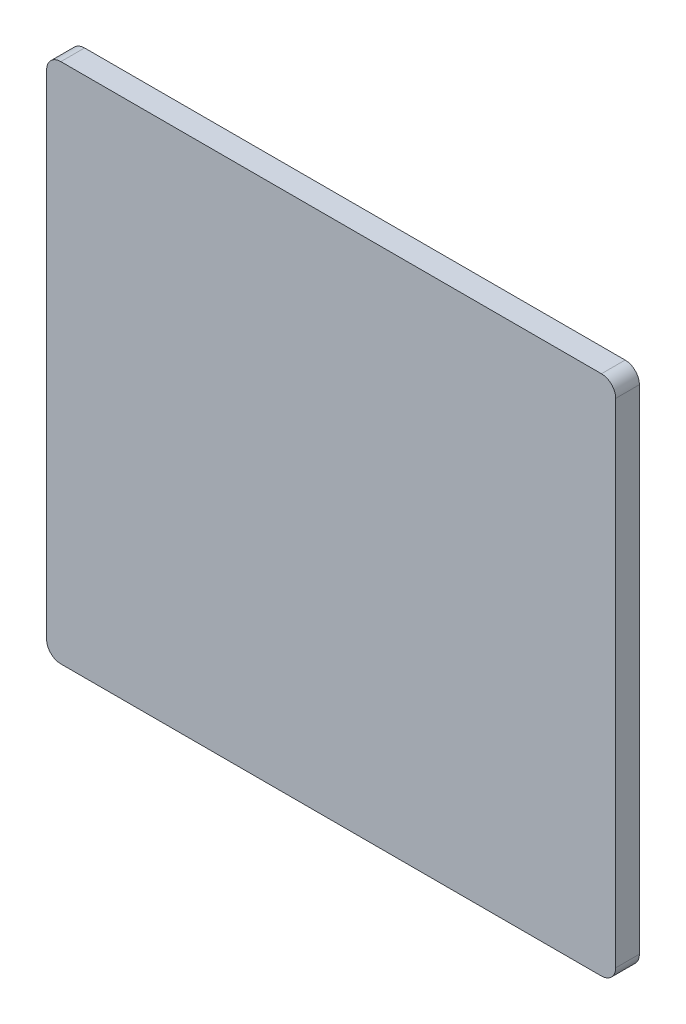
ISO-10303-21;
HEADER;
FILE_DESCRIPTION(('STEP AP214'),'2;1');
FILE_NAME('part.step','',(''),(''),'','','');
FILE_SCHEMA(('AUTOMOTIVE_DESIGN { 1 0 10303 214 1 1 1 1 }'));
ENDSEC;
DATA;
#1=APPLICATION_CONTEXT('core data for automotive mechanical design processes');
#2=APPLICATION_PROTOCOL_DEFINITION('international standard','automotive_design',2000,#1);
#3=PRODUCT_CONTEXT('',#1,'mechanical');
#4=PRODUCT('Part','Part','',(#3));
#5=PRODUCT_RELATED_PRODUCT_CATEGORY('part','',(#4));
#6=PRODUCT_DEFINITION_FORMATION('','',#4);
#7=PRODUCT_DEFINITION_CONTEXT('part definition',#1,'design');
#8=PRODUCT_DEFINITION('design','',#6,#7);
#9=PRODUCT_DEFINITION_SHAPE('','',#8);
#10=(LENGTH_UNIT() NAMED_UNIT(*) SI_UNIT(.MILLI.,.METRE.));
#11=(NAMED_UNIT(*) PLANE_ANGLE_UNIT() SI_UNIT($,.RADIAN.));
#12=(NAMED_UNIT(*) SI_UNIT($,.STERADIAN.) SOLID_ANGLE_UNIT());
#13=UNCERTAINTY_MEASURE_WITH_UNIT(LENGTH_MEASURE(1.E-05),#10,'distance_accuracy_value','');
#14=(GEOMETRIC_REPRESENTATION_CONTEXT(3) GLOBAL_UNCERTAINTY_ASSIGNED_CONTEXT((#13)) GLOBAL_UNIT_ASSIGNED_CONTEXT((#10,
#11,#12)) REPRESENTATION_CONTEXT('',''));
#15=CARTESIAN_POINT('',(0.,0.,0.));
#16=DIRECTION('',(0.,0.,1.));
#17=DIRECTION('',(1.,0.,0.));
#18=AXIS2_PLACEMENT_3D('',#15,#16,#17);
#19=CARTESIAN_POINT('',(-60.,-55.,2.5));
#20=DIRECTION('',(1.,0.,0.));
#21=DIRECTION('',(0.,0.,-1.));
#22=AXIS2_PLACEMENT_3D('',#19,#20,#21);
#23=PLANE('',#22);
#24=DIRECTION('',(0.,-1.,0.));
#25=VECTOR('',#24,1.);
#26=CARTESIAN_POINT('',(-60.,-55.,-2.5));
#27=LINE('',#26,#25);
#28=CARTESIAN_POINT('',(-60.,52.,-2.5));
#29=VERTEX_POINT('',#28);
#30=CARTESIAN_POINT('',(-60.,-52.,-2.5));
#31=VERTEX_POINT('',#30);
#32=EDGE_CURVE('E126',#29,#31,#27,.T.);
#33=ORIENTED_EDGE('',*,*,#32,.T.);
#34=DIRECTION('',(0.,0.,-1.));
#35=VECTOR('',#34,1.);
#36=CARTESIAN_POINT('',(-60.,-52.,2.5));
#37=LINE('',#36,#35);
#38=CARTESIAN_POINT('',(-60.,-52.,2.5));
#39=VERTEX_POINT('',#38);
#40=EDGE_CURVE('E104',#31,#39,#37,.F.);
#41=ORIENTED_EDGE('',*,*,#40,.T.);
#42=DIRECTION('',(0.,-1.,0.));
#43=VECTOR('',#42,1.);
#44=CARTESIAN_POINT('',(-60.,-55.,2.5));
#45=LINE('',#44,#43);
#46=CARTESIAN_POINT('',(-60.,52.,2.5));
#47=VERTEX_POINT('',#46);
#48=EDGE_CURVE('E135',#47,#39,#45,.T.);
#49=ORIENTED_EDGE('',*,*,#48,.F.);
#50=DIRECTION('',(0.,0.,-1.));
#51=VECTOR('',#50,1.);
#52=CARTESIAN_POINT('',(-60.,52.,2.5));
#53=LINE('',#52,#51);
#54=EDGE_CURVE('E109',#47,#29,#53,.T.);
#55=ORIENTED_EDGE('',*,*,#54,.T.);
#56=EDGE_LOOP('',(#33,#41,#49,#55));
#57=FACE_BOUND('',#56,.T.);
#58=ADVANCED_FACE('F33',(#57),#23,.F.);
#59=CARTESIAN_POINT('',(60.,-55.,2.5));
#60=DIRECTION('',(0.,1.,0.));
#61=DIRECTION('',(-1.,0.,0.));
#62=AXIS2_PLACEMENT_3D('',#59,#60,#61);
#63=PLANE('',#62);
#64=DIRECTION('',(1.,0.,0.));
#65=VECTOR('',#64,1.);
#66=CARTESIAN_POINT('',(60.,-55.,2.5));
#67=LINE('',#66,#65);
#68=CARTESIAN_POINT('',(-57.,-55.,2.5));
#69=VERTEX_POINT('',#68);
#70=CARTESIAN_POINT('',(57.,-55.,2.5));
#71=VERTEX_POINT('',#70);
#72=EDGE_CURVE('E119',#69,#71,#67,.T.);
#73=ORIENTED_EDGE('',*,*,#72,.F.);
#74=DIRECTION('',(0.,0.,-1.));
#75=VECTOR('',#74,1.);
#76=CARTESIAN_POINT('',(-57.,-55.,2.5));
#77=LINE('',#76,#75);
#78=CARTESIAN_POINT('',(-57.,-55.,-2.5));
#79=VERTEX_POINT('',#78);
#80=EDGE_CURVE('E103',#69,#79,#77,.T.);
#81=ORIENTED_EDGE('',*,*,#80,.T.);
#82=DIRECTION('',(1.,0.,0.));
#83=VECTOR('',#82,1.);
#84=CARTESIAN_POINT('',(60.,-55.,-2.5));
#85=LINE('',#84,#83);
#86=CARTESIAN_POINT('',(57.,-55.,-2.5));
#87=VERTEX_POINT('',#86);
#88=EDGE_CURVE('E116',#79,#87,#85,.T.);
#89=ORIENTED_EDGE('',*,*,#88,.T.);
#90=DIRECTION('',(0.,0.,-1.));
#91=VECTOR('',#90,1.);
#92=CARTESIAN_POINT('',(57.,-55.,2.5));
#93=LINE('',#92,#91);
#94=EDGE_CURVE('E121',#87,#71,#93,.F.);
#95=ORIENTED_EDGE('',*,*,#94,.T.);
#96=EDGE_LOOP('',(#73,#81,#89,#95));
#97=FACE_BOUND('',#96,.T.);
#98=ADVANCED_FACE('F115',(#97),#63,.F.);
#99=CARTESIAN_POINT('',(60.,-55.,2.5));
#100=DIRECTION('',(-1.,0.,0.));
#101=DIRECTION('',(0.,0.,1.));
#102=AXIS2_PLACEMENT_3D('',#99,#100,#101);
#103=PLANE('',#102);
#104=DIRECTION('',(0.,1.,0.));
#105=VECTOR('',#104,1.);
#106=CARTESIAN_POINT('',(60.,-55.,2.5));
#107=LINE('',#106,#105);
#108=CARTESIAN_POINT('',(60.,-52.,2.5));
#109=VERTEX_POINT('',#108);
#110=CARTESIAN_POINT('',(60.,52.,2.5));
#111=VERTEX_POINT('',#110);
#112=EDGE_CURVE('E161',#109,#111,#107,.T.);
#113=ORIENTED_EDGE('',*,*,#112,.F.);
#114=DIRECTION('',(0.,0.,-1.));
#115=VECTOR('',#114,1.);
#116=CARTESIAN_POINT('',(60.,-52.,2.5));
#117=LINE('',#116,#115);
#118=CARTESIAN_POINT('',(60.,-52.,-2.5));
#119=VERTEX_POINT('',#118);
#120=EDGE_CURVE('E154',#109,#119,#117,.T.);
#121=ORIENTED_EDGE('',*,*,#120,.T.);
#122=DIRECTION('',(0.,1.,0.));
#123=VECTOR('',#122,1.);
#124=CARTESIAN_POINT('',(60.,-55.,-2.5));
#125=LINE('',#124,#123);
#126=CARTESIAN_POINT('',(60.,52.,-2.5));
#127=VERTEX_POINT('',#126);
#128=EDGE_CURVE('E125',#119,#127,#125,.T.);
#129=ORIENTED_EDGE('',*,*,#128,.T.);
#130=DIRECTION('',(0.,0.,-1.));
#131=VECTOR('',#130,1.);
#132=CARTESIAN_POINT('',(60.,52.,2.5));
#133=LINE('',#132,#131);
#134=EDGE_CURVE('E152',#127,#111,#133,.F.);
#135=ORIENTED_EDGE('',*,*,#134,.T.);
#136=EDGE_LOOP('',(#113,#121,#129,#135));
#137=FACE_BOUND('',#136,.T.);
#138=ADVANCED_FACE('F159',(#137),#103,.F.);
#139=CARTESIAN_POINT('',(60.,55.,2.5));
#140=DIRECTION('',(0.,-1.,0.));
#141=DIRECTION('',(1.,0.,0.));
#142=AXIS2_PLACEMENT_3D('',#139,#140,#141);
#143=PLANE('',#142);
#144=DIRECTION('',(-1.,0.,0.));
#145=VECTOR('',#144,1.);
#146=CARTESIAN_POINT('',(60.,55.,2.5));
#147=LINE('',#146,#145);
#148=CARTESIAN_POINT('',(57.,55.,2.5));
#149=VERTEX_POINT('',#148);
#150=CARTESIAN_POINT('',(-57.,55.,2.5));
#151=VERTEX_POINT('',#150);
#152=EDGE_CURVE('E136',#149,#151,#147,.T.);
#153=ORIENTED_EDGE('',*,*,#152,.F.);
#154=DIRECTION('',(0.,0.,-1.));
#155=VECTOR('',#154,1.);
#156=CARTESIAN_POINT('',(57.,55.,2.5));
#157=LINE('',#156,#155);
#158=CARTESIAN_POINT('',(57.,55.,-2.5));
#159=VERTEX_POINT('',#158);
#160=EDGE_CURVE('E11',#149,#159,#157,.T.);
#161=ORIENTED_EDGE('',*,*,#160,.T.);
#162=DIRECTION('',(-1.,0.,0.));
#163=VECTOR('',#162,1.);
#164=CARTESIAN_POINT('',(60.,55.,-2.5));
#165=LINE('',#164,#163);
#166=CARTESIAN_POINT('',(-57.,55.,-2.5));
#167=VERTEX_POINT('',#166);
#168=EDGE_CURVE('E129',#159,#167,#165,.T.);
#169=ORIENTED_EDGE('',*,*,#168,.T.);
#170=DIRECTION('',(0.,0.,-1.));
#171=VECTOR('',#170,1.);
#172=CARTESIAN_POINT('',(-57.,55.,2.5));
#173=LINE('',#172,#171);
#174=EDGE_CURVE('E41',#167,#151,#173,.F.);
#175=ORIENTED_EDGE('',*,*,#174,.T.);
#176=EDGE_LOOP('',(#153,#161,#169,#175));
#177=FACE_BOUND('',#176,.T.);
#178=ADVANCED_FACE('F168',(#177),#143,.F.);
#179=CARTESIAN_POINT('',(0.,0.,2.5));
#180=DIRECTION('',(0.,0.,1.));
#181=DIRECTION('',(1.,0.,0.));
#182=AXIS2_PLACEMENT_3D('',#179,#180,#181);
#183=PLANE('',#182);
#184=ORIENTED_EDGE('',*,*,#48,.T.);
#185=CARTESIAN_POINT('',(-57.,-52.,2.5));
#186=DIRECTION('',(0.,0.,1.));
#187=DIRECTION('',(1.,0.,0.));
#188=AXIS2_PLACEMENT_3D('',#185,#186,#187);
#189=CIRCLE('',#188,3.);
#190=EDGE_CURVE('E150',#39,#69,#189,.T.);
#191=ORIENTED_EDGE('',*,*,#190,.T.);
#192=ORIENTED_EDGE('',*,*,#72,.T.);
#193=CARTESIAN_POINT('',(57.,-52.,2.5));
#194=DIRECTION('',(0.,0.,1.));
#195=DIRECTION('',(1.,0.,0.));
#196=AXIS2_PLACEMENT_3D('',#193,#194,#195);
#197=CIRCLE('',#196,3.);
#198=EDGE_CURVE('E148',#71,#109,#197,.T.);
#199=ORIENTED_EDGE('',*,*,#198,.T.);
#200=ORIENTED_EDGE('',*,*,#112,.T.);
#201=CARTESIAN_POINT('',(57.,52.,2.5));
#202=DIRECTION('',(0.,0.,1.));
#203=DIRECTION('',(1.,0.,0.));
#204=AXIS2_PLACEMENT_3D('',#201,#202,#203);
#205=CIRCLE('',#204,3.);
#206=EDGE_CURVE('E54',#111,#149,#205,.T.);
#207=ORIENTED_EDGE('',*,*,#206,.T.);
#208=ORIENTED_EDGE('',*,*,#152,.T.);
#209=CARTESIAN_POINT('',(-57.,52.,2.5));
#210=DIRECTION('',(0.,0.,1.));
#211=DIRECTION('',(1.,0.,0.));
#212=AXIS2_PLACEMENT_3D('',#209,#210,#211);
#213=CIRCLE('',#212,3.);
#214=EDGE_CURVE('E145',#151,#47,#213,.T.);
#215=ORIENTED_EDGE('',*,*,#214,.T.);
#216=EDGE_LOOP('',(#184,#191,#192,#199,#200,#207,#208,#215));
#217=FACE_BOUND('',#216,.T.);
#218=ADVANCED_FACE('F175',(#217),#183,.T.);
#219=CARTESIAN_POINT('',(0.,0.,-2.5));
#220=DIRECTION('',(0.,0.,1.));
#221=DIRECTION('',(1.,0.,0.));
#222=AXIS2_PLACEMENT_3D('',#219,#220,#221);
#223=PLANE('',#222);
#224=ORIENTED_EDGE('',*,*,#88,.F.);
#225=CARTESIAN_POINT('',(-57.,-52.,-2.5));
#226=DIRECTION('',(0.,0.,1.));
#227=DIRECTION('',(1.,0.,0.));
#228=AXIS2_PLACEMENT_3D('',#225,#226,#227);
#229=CIRCLE('',#228,3.);
#230=EDGE_CURVE('E99',#79,#31,#229,.F.);
#231=ORIENTED_EDGE('',*,*,#230,.T.);
#232=ORIENTED_EDGE('',*,*,#32,.F.);
#233=CARTESIAN_POINT('',(-57.,52.,-2.5));
#234=DIRECTION('',(0.,0.,1.));
#235=DIRECTION('',(1.,0.,0.));
#236=AXIS2_PLACEMENT_3D('',#233,#234,#235);
#237=CIRCLE('',#236,3.);
#238=EDGE_CURVE('E120',#29,#167,#237,.F.);
#239=ORIENTED_EDGE('',*,*,#238,.T.);
#240=ORIENTED_EDGE('',*,*,#168,.F.);
#241=CARTESIAN_POINT('',(57.,52.,-2.5));
#242=DIRECTION('',(0.,0.,1.));
#243=DIRECTION('',(1.,0.,0.));
#244=AXIS2_PLACEMENT_3D('',#241,#242,#243);
#245=CIRCLE('',#244,3.);
#246=EDGE_CURVE('E139',#159,#127,#245,.F.);
#247=ORIENTED_EDGE('',*,*,#246,.T.);
#248=ORIENTED_EDGE('',*,*,#128,.F.);
#249=CARTESIAN_POINT('',(57.,-52.,-2.5));
#250=DIRECTION('',(0.,0.,1.));
#251=DIRECTION('',(1.,0.,0.));
#252=AXIS2_PLACEMENT_3D('',#249,#250,#251);
#253=CIRCLE('',#252,3.);
#254=EDGE_CURVE('E110',#119,#87,#253,.F.);
#255=ORIENTED_EDGE('',*,*,#254,.T.);
#256=EDGE_LOOP('',(#224,#231,#232,#239,#240,#247,#248,#255));
#257=FACE_BOUND('',#256,.T.);
#258=ADVANCED_FACE('F123',(#257),#223,.F.);
#259=CARTESIAN_POINT('',(-57.,-52.,2.5));
#260=DIRECTION('',(0.,0.,-1.));
#261=DIRECTION('',(-1.,0.,0.));
#262=AXIS2_PLACEMENT_3D('',#259,#260,#261);
#263=CYLINDRICAL_SURFACE('',#262,3.);
#264=ORIENTED_EDGE('',*,*,#190,.F.);
#265=ORIENTED_EDGE('',*,*,#40,.F.);
#266=ORIENTED_EDGE('',*,*,#230,.F.);
#267=ORIENTED_EDGE('',*,*,#80,.F.);
#268=EDGE_LOOP('',(#264,#265,#266,#267));
#269=FACE_BOUND('',#268,.T.);
#270=ADVANCED_FACE('F102',(#269),#263,.T.);
#271=CARTESIAN_POINT('',(57.,-52.,2.5));
#272=DIRECTION('',(0.,0.,-1.));
#273=DIRECTION('',(-1.,0.,0.));
#274=AXIS2_PLACEMENT_3D('',#271,#272,#273);
#275=CYLINDRICAL_SURFACE('',#274,3.);
#276=ORIENTED_EDGE('',*,*,#198,.F.);
#277=ORIENTED_EDGE('',*,*,#94,.F.);
#278=ORIENTED_EDGE('',*,*,#254,.F.);
#279=ORIENTED_EDGE('',*,*,#120,.F.);
#280=EDGE_LOOP('',(#276,#277,#278,#279));
#281=FACE_BOUND('',#280,.T.);
#282=ADVANCED_FACE('F183',(#281),#275,.T.);
#283=CARTESIAN_POINT('',(57.,52.,2.5));
#284=DIRECTION('',(0.,0.,-1.));
#285=DIRECTION('',(-1.,0.,0.));
#286=AXIS2_PLACEMENT_3D('',#283,#284,#285);
#287=CYLINDRICAL_SURFACE('',#286,3.);
#288=ORIENTED_EDGE('',*,*,#206,.F.);
#289=ORIENTED_EDGE('',*,*,#134,.F.);
#290=ORIENTED_EDGE('',*,*,#246,.F.);
#291=ORIENTED_EDGE('',*,*,#160,.F.);
#292=EDGE_LOOP('',(#288,#289,#290,#291));
#293=FACE_BOUND('',#292,.T.);
#294=ADVANCED_FACE('F167',(#293),#287,.T.);
#295=CARTESIAN_POINT('',(-57.,52.,2.5));
#296=DIRECTION('',(0.,0.,-1.));
#297=DIRECTION('',(-1.,0.,0.));
#298=AXIS2_PLACEMENT_3D('',#295,#296,#297);
#299=CYLINDRICAL_SURFACE('',#298,3.);
#300=ORIENTED_EDGE('',*,*,#214,.F.);
#301=ORIENTED_EDGE('',*,*,#174,.F.);
#302=ORIENTED_EDGE('',*,*,#238,.F.);
#303=ORIENTED_EDGE('',*,*,#54,.F.);
#304=EDGE_LOOP('',(#300,#301,#302,#303));
#305=FACE_BOUND('',#304,.T.);
#306=ADVANCED_FACE('F35',(#305),#299,.T.);
#307=CLOSED_SHELL('',(#58,#98,#138,#178,#218,#258,#270,#282,#294,#306));
#308=MANIFOLD_SOLID_BREP('B2',#307);
#309=ADVANCED_BREP_SHAPE_REPRESENTATION('',(#18,#308),#14);
#310=SHAPE_DEFINITION_REPRESENTATION(#9,#309);
ENDSEC;
END-ISO-10303-21;
